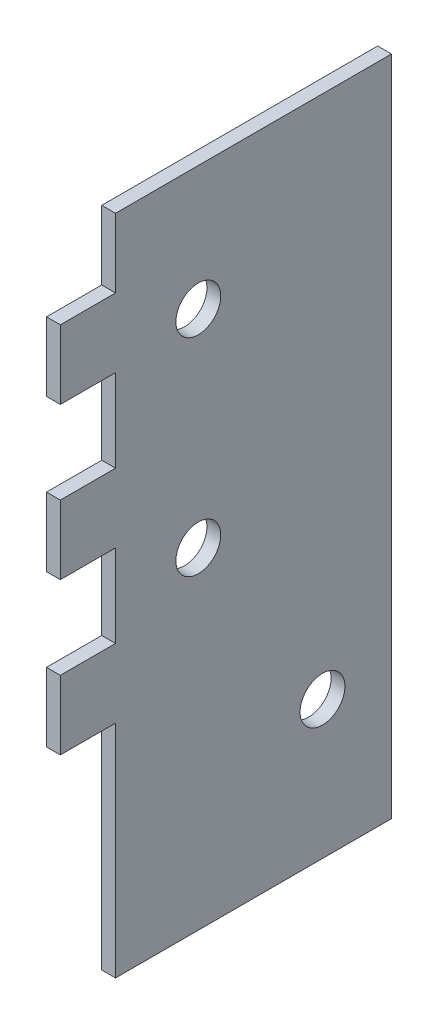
from build123d import *

# Parameters (mm, degrees)
SKETCH1_W           = 6.35
SKETCH1_H           = 127
BOSS_EXTRUDE1_DEPTH = 304.8
SKETCH2_R           = 10.31875
CUT_EXTRUDE1_DEPTH  = 304.8
SKETCH3_W           = 6.35
SKETCH3_H           = 31.75
BOSS_EXTRUDE2_DEPTH = 25.4


with BuildPart() as part:
    # Sketch1 → Boss-Extrude1 (new body)
    with BuildSketch(Plane(origin=(0, 0, 0), x_dir=(1, 0, 0), z_dir=(0, 1, 0))):
        Rectangle(SKETCH1_W, SKETCH1_H)
    extrude(amount=BOSS_EXTRUDE1_DEPTH)

    # Sketch2 → Cut-Extrude1 (cut)
    with BuildSketch(Plane(origin=(3.175, 0, 0), x_dir=(0, 0, -1), z_dir=(1, 0, 0))):
        with Locations((-25.4, 247.65)):
            Circle(SKETCH2_R)
        with Locations((-25.4, 152.4)):
            Circle(SKETCH2_R)
        with Locations((31.75, 63.5)):
            Circle(SKETCH2_R)
    extrude(amount=-CUT_EXTRUDE1_DEPTH, mode=Mode.SUBTRACT)

    # Sketch3 → Boss-Extrude2 (add)
    with BuildSketch(Plane.XY.offset(63.5)):
        with Locations((0, 257.175)):
            Rectangle(SKETCH3_W, SKETCH3_H)
        with Locations((0, 187.325)):
            Rectangle(SKETCH3_W, SKETCH3_H)
        with Locations((0, 117.475)):
            Rectangle(SKETCH3_W, SKETCH3_H)
    extrude(amount=BOSS_EXTRUDE2_DEPTH)


solid = part.part
